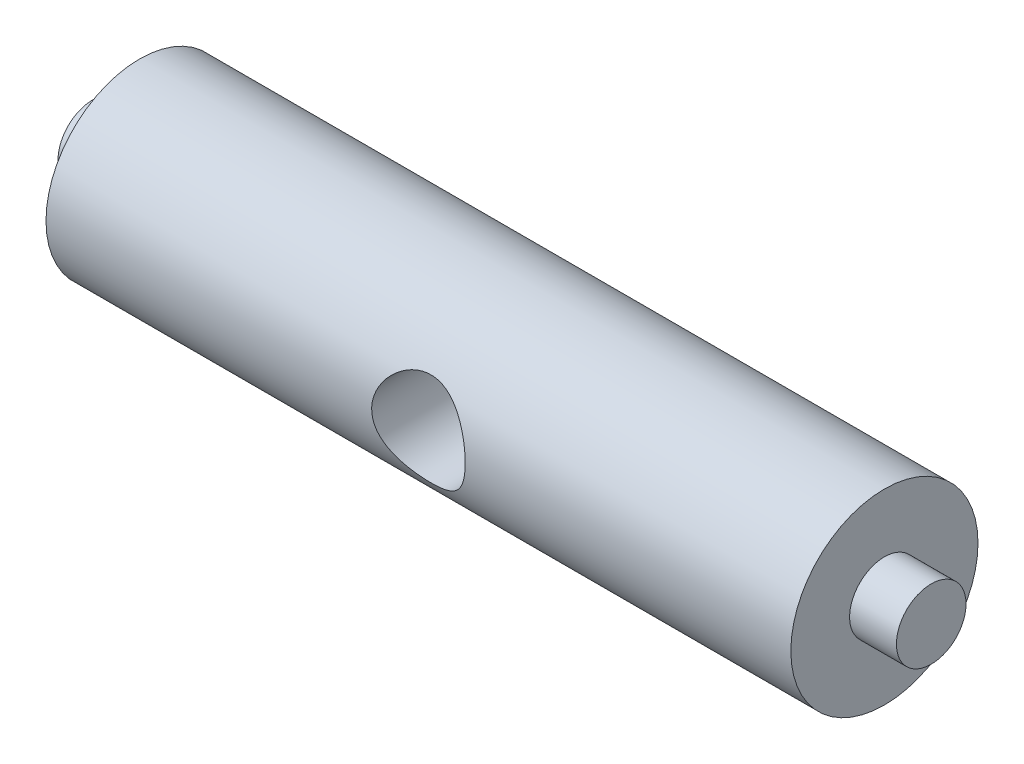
from build123d import *

# Parameters (mm, degrees)
SKETCH9_R          = 3.175
CUT_EXTRUDE1_DEPTH = 32.794672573


with BuildPart() as part:
    # Sketch6 → Base-Revolve (revolve)
    with BuildSketch(Plane.XY, mode=Mode.PRIVATE) as base_revolve_sk:
        Polygon((-28.448, 0), (-28.448, -2.3622), (-25.273, -2.3622), (-25.273, -6.35), (25.273, -6.35), (25.273, -2.3622), (28.448, -2.3622), (28.448, 0), align=None)
    revolve(base_revolve_sk.sketch.rotate(Axis((82.551175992, 0, 0), (-1, 0, 0)), 270), axis=Axis((82.551175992, 0, 0), (-1, 0, 0)))

    # Sketch9 → Cut-Extrude1 (cut, through all)
    with BuildSketch(Plane.XY.offset(6.35)):
        Circle(SKETCH9_R)
    extrude(amount=-CUT_EXTRUDE1_DEPTH, mode=Mode.SUBTRACT)


solid = part.part
